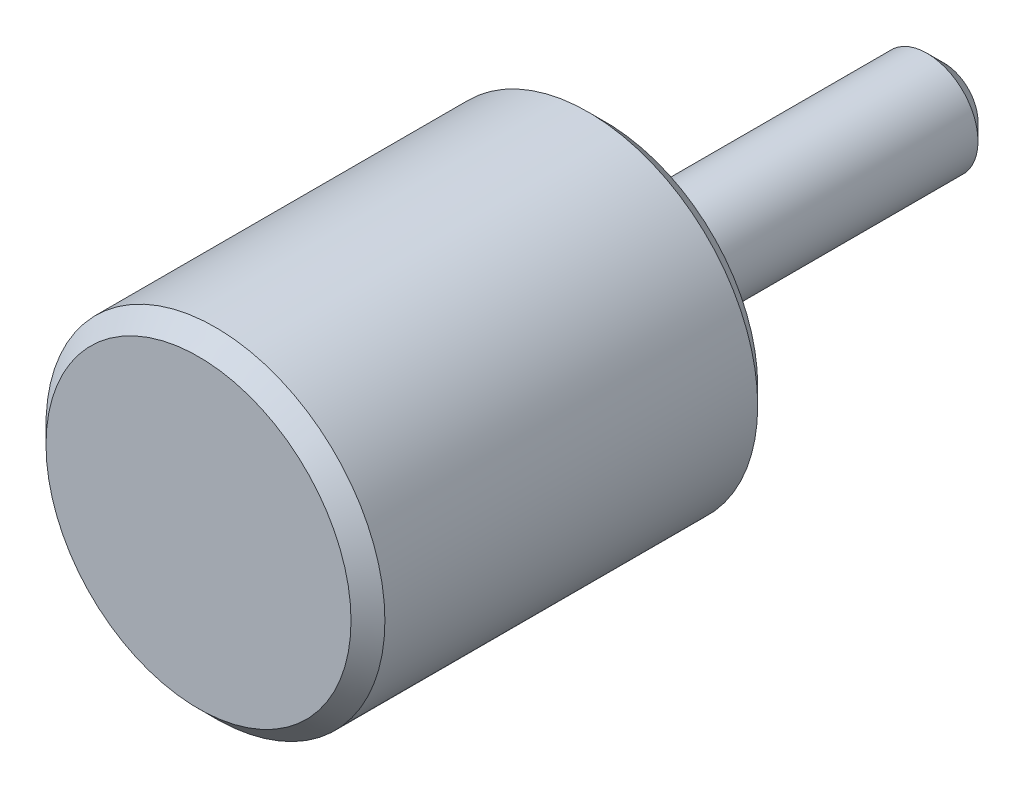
ISO-10303-21;
HEADER;
FILE_DESCRIPTION(('STEP AP214'),'2;1');
FILE_NAME('part.step','',(''),(''),'','','');
FILE_SCHEMA(('AUTOMOTIVE_DESIGN { 1 0 10303 214 1 1 1 1 }'));
ENDSEC;
DATA;
#1=APPLICATION_CONTEXT('core data for automotive mechanical design processes');
#2=APPLICATION_PROTOCOL_DEFINITION('international standard','automotive_design',2000,#1);
#3=PRODUCT_CONTEXT('',#1,'mechanical');
#4=PRODUCT('Part','Part','',(#3));
#5=PRODUCT_RELATED_PRODUCT_CATEGORY('part','',(#4));
#6=PRODUCT_DEFINITION_FORMATION('','',#4);
#7=PRODUCT_DEFINITION_CONTEXT('part definition',#1,'design');
#8=PRODUCT_DEFINITION('design','',#6,#7);
#9=PRODUCT_DEFINITION_SHAPE('','',#8);
#10=(LENGTH_UNIT() NAMED_UNIT(*) SI_UNIT(.MILLI.,.METRE.));
#11=(NAMED_UNIT(*) PLANE_ANGLE_UNIT() SI_UNIT($,.RADIAN.));
#12=(NAMED_UNIT(*) SI_UNIT($,.STERADIAN.) SOLID_ANGLE_UNIT());
#13=UNCERTAINTY_MEASURE_WITH_UNIT(LENGTH_MEASURE(1.E-05),#10,'distance_accuracy_value','');
#14=(GEOMETRIC_REPRESENTATION_CONTEXT(3) GLOBAL_UNCERTAINTY_ASSIGNED_CONTEXT((#13)) GLOBAL_UNIT_ASSIGNED_CONTEXT((#10,
#11,#12)) REPRESENTATION_CONTEXT('',''));
#15=CARTESIAN_POINT('',(0.,0.,0.));
#16=DIRECTION('',(0.,0.,1.));
#17=DIRECTION('',(1.,0.,0.));
#18=AXIS2_PLACEMENT_3D('',#15,#16,#17);
#19=CARTESIAN_POINT('',(0.,0.,24.));
#20=DIRECTION('',(0.,0.,-1.));
#21=DIRECTION('',(-1.,0.,0.));
#22=AXIS2_PLACEMENT_3D('',#19,#20,#21);
#23=CYLINDRICAL_SURFACE('',#22,10.);
#24=CARTESIAN_POINT('',(0.,0.,23.));
#25=DIRECTION('',(0.,0.,1.));
#26=DIRECTION('',(1.,0.,0.));
#27=AXIS2_PLACEMENT_3D('',#24,#25,#26);
#28=CIRCLE('',#27,10.);
#29=CARTESIAN_POINT('',(10.,0.,23.));
#30=VERTEX_POINT('',#29);
#31=EDGE_CURVE('E24',#30,#30,#28,.F.);
#32=ORIENTED_EDGE('',*,*,#31,.T.);
#33=EDGE_LOOP('',(#32));
#34=FACE_BOUND('',#33,.T.);
#35=CARTESIAN_POINT('',(0.,0.,1.));
#36=DIRECTION('',(0.,0.,1.));
#37=DIRECTION('',(1.,0.,0.));
#38=AXIS2_PLACEMENT_3D('',#35,#36,#37);
#39=CIRCLE('',#38,10.);
#40=CARTESIAN_POINT('',(10.,0.,1.));
#41=VERTEX_POINT('',#40);
#42=EDGE_CURVE('E35',#41,#41,#39,.T.);
#43=ORIENTED_EDGE('',*,*,#42,.T.);
#44=EDGE_LOOP('',(#43));
#45=FACE_BOUND('',#44,.T.);
#46=ADVANCED_FACE('F12',(#34,#45),#23,.T.);
#47=CARTESIAN_POINT('',(0.,0.,24.));
#48=DIRECTION('',(0.,0.,1.));
#49=DIRECTION('',(1.,0.,0.));
#50=AXIS2_PLACEMENT_3D('',#47,#48,#49);
#51=PLANE('',#50);
#52=CARTESIAN_POINT('',(0.,0.,24.));
#53=DIRECTION('',(0.,0.,1.));
#54=DIRECTION('',(1.,0.,0.));
#55=AXIS2_PLACEMENT_3D('',#52,#53,#54);
#56=CIRCLE('',#55,9.);
#57=CARTESIAN_POINT('',(9.,0.,24.));
#58=VERTEX_POINT('',#57);
#59=EDGE_CURVE('E29',#58,#58,#56,.T.);
#60=ORIENTED_EDGE('',*,*,#59,.T.);
#61=EDGE_LOOP('',(#60));
#62=FACE_BOUND('',#61,.T.);
#63=ADVANCED_FACE('F47',(#62),#51,.T.);
#64=CARTESIAN_POINT('',(0.,0.,0.));
#65=DIRECTION('',(0.,0.,1.));
#66=DIRECTION('',(1.,0.,0.));
#67=AXIS2_PLACEMENT_3D('',#64,#65,#66);
#68=PLANE('',#67);
#69=CARTESIAN_POINT('',(0.,0.,0.));
#70=DIRECTION('',(0.,0.,1.));
#71=DIRECTION('',(1.,0.,0.));
#72=AXIS2_PLACEMENT_3D('',#69,#70,#71);
#73=CIRCLE('',#72,9.);
#74=CARTESIAN_POINT('',(9.,0.,0.));
#75=VERTEX_POINT('',#74);
#76=EDGE_CURVE('E32',#75,#75,#73,.F.);
#77=ORIENTED_EDGE('',*,*,#76,.T.);
#78=EDGE_LOOP('',(#77));
#79=FACE_BOUND('',#78,.T.);
#80=CARTESIAN_POINT('',(0.,0.,0.));
#81=DIRECTION('',(0.,0.,-1.));
#82=DIRECTION('',(-1.,0.,0.));
#83=AXIS2_PLACEMENT_3D('',#80,#81,#82);
#84=CIRCLE('',#83,3.);
#85=CARTESIAN_POINT('',(-3.,0.,0.));
#86=VERTEX_POINT('',#85);
#87=EDGE_CURVE('E16',#86,#86,#84,.T.);
#88=ORIENTED_EDGE('',*,*,#87,.F.);
#89=EDGE_LOOP('',(#88));
#90=FACE_BOUND('',#89,.T.);
#91=ADVANCED_FACE('F44',(#79,#90),#68,.F.);
#92=CARTESIAN_POINT('',(0.,0.,1.));
#93=DIRECTION('',(0.,0.,1.));
#94=DIRECTION('',(1.,0.,0.));
#95=AXIS2_PLACEMENT_3D('',#92,#93,#94);
#96=CONICAL_SURFACE('',#95,10.,0.78539816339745);
#97=ORIENTED_EDGE('',*,*,#76,.F.);
#98=EDGE_LOOP('',(#97));
#99=FACE_BOUND('',#98,.T.);
#100=ORIENTED_EDGE('',*,*,#42,.F.);
#101=EDGE_LOOP('',(#100));
#102=FACE_BOUND('',#101,.T.);
#103=ADVANCED_FACE('F46',(#99,#102),#96,.T.);
#104=CARTESIAN_POINT('',(0.,0.,24.));
#105=DIRECTION('',(0.,0.,-1.));
#106=DIRECTION('',(-1.,0.,0.));
#107=AXIS2_PLACEMENT_3D('',#104,#105,#106);
#108=CONICAL_SURFACE('',#107,9.,0.785398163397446);
#109=ORIENTED_EDGE('',*,*,#31,.F.);
#110=EDGE_LOOP('',(#109));
#111=FACE_BOUND('',#110,.T.);
#112=ORIENTED_EDGE('',*,*,#59,.F.);
#113=EDGE_LOOP('',(#112));
#114=FACE_BOUND('',#113,.T.);
#115=ADVANCED_FACE('F55',(#111,#114),#108,.T.);
#116=CARTESIAN_POINT('',(0.,0.,-20.));
#117=DIRECTION('',(0.,0.,1.));
#118=DIRECTION('',(1.,0.,0.));
#119=AXIS2_PLACEMENT_3D('',#116,#117,#118);
#120=PLANE('',#119);
#121=CARTESIAN_POINT('',(0.,0.,-20.));
#122=DIRECTION('',(0.,0.,1.));
#123=DIRECTION('',(1.,0.,0.));
#124=AXIS2_PLACEMENT_3D('',#121,#122,#123);
#125=CIRCLE('',#124,2.);
#126=CARTESIAN_POINT('',(2.,0.,-20.));
#127=VERTEX_POINT('',#126);
#128=EDGE_CURVE('E8',#127,#127,#125,.F.);
#129=ORIENTED_EDGE('',*,*,#128,.T.);
#130=EDGE_LOOP('',(#129));
#131=FACE_BOUND('',#130,.T.);
#132=ADVANCED_FACE('F68',(#131),#120,.F.);
#133=CARTESIAN_POINT('',(0.,0.,-19.));
#134=DIRECTION('',(0.,0.,1.));
#135=DIRECTION('',(1.,0.,0.));
#136=AXIS2_PLACEMENT_3D('',#133,#134,#135);
#137=CONICAL_SURFACE('',#136,3.,0.78539816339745);
#138=ORIENTED_EDGE('',*,*,#128,.F.);
#139=EDGE_LOOP('',(#138));
#140=FACE_BOUND('',#139,.T.);
#141=CARTESIAN_POINT('',(0.,0.,-19.));
#142=DIRECTION('',(0.,0.,1.));
#143=DIRECTION('',(1.,0.,0.));
#144=AXIS2_PLACEMENT_3D('',#141,#142,#143);
#145=CIRCLE('',#144,3.);
#146=CARTESIAN_POINT('',(3.,0.,-19.));
#147=VERTEX_POINT('',#146);
#148=EDGE_CURVE('E20',#147,#147,#145,.T.);
#149=ORIENTED_EDGE('',*,*,#148,.F.);
#150=EDGE_LOOP('',(#149));
#151=FACE_BOUND('',#150,.T.);
#152=ADVANCED_FACE('F66',(#140,#151),#137,.T.);
#153=CARTESIAN_POINT('',(0.,0.,10.));
#154=DIRECTION('',(0.,0.,-1.));
#155=DIRECTION('',(-1.,0.,0.));
#156=AXIS2_PLACEMENT_3D('',#153,#154,#155);
#157=CYLINDRICAL_SURFACE('',#156,3.);
#158=ORIENTED_EDGE('',*,*,#87,.T.);
#159=EDGE_LOOP('',(#158));
#160=FACE_BOUND('',#159,.T.);
#161=ORIENTED_EDGE('',*,*,#148,.T.);
#162=EDGE_LOOP('',(#161));
#163=FACE_BOUND('',#162,.T.);
#164=ADVANCED_FACE('F14',(#160,#163),#157,.T.);
#165=CLOSED_SHELL('',(#46,#63,#91,#103,#115,#132,#152,#164));
#166=MANIFOLD_SOLID_BREP('B1',#165);
#167=ADVANCED_BREP_SHAPE_REPRESENTATION('',(#18,#166),#14);
#168=SHAPE_DEFINITION_REPRESENTATION(#9,#167);
ENDSEC;
END-ISO-10303-21;
